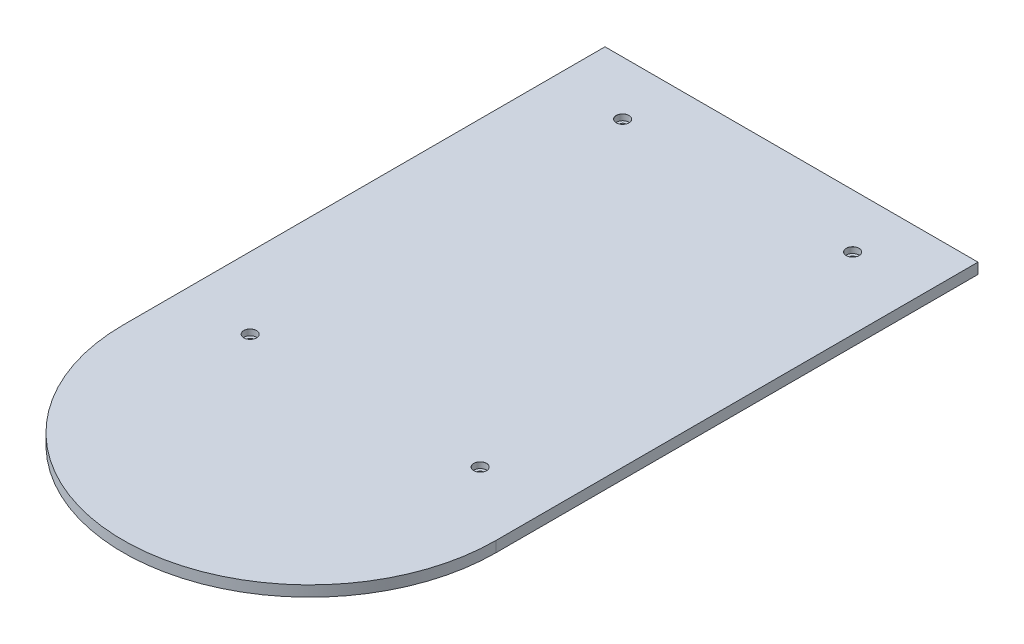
ISO-10303-21;
HEADER;
FILE_DESCRIPTION(('STEP AP214'),'2;1');
FILE_NAME('part.step','',(''),(''),'','','');
FILE_SCHEMA(('AUTOMOTIVE_DESIGN { 1 0 10303 214 1 1 1 1 }'));
ENDSEC;
DATA;
#1=APPLICATION_CONTEXT('core data for automotive mechanical design processes');
#2=APPLICATION_PROTOCOL_DEFINITION('international standard','automotive_design',2000,#1);
#3=PRODUCT_CONTEXT('',#1,'mechanical');
#4=PRODUCT('Part','Part','',(#3));
#5=PRODUCT_RELATED_PRODUCT_CATEGORY('part','',(#4));
#6=PRODUCT_DEFINITION_FORMATION('','',#4);
#7=PRODUCT_DEFINITION_CONTEXT('part definition',#1,'design');
#8=PRODUCT_DEFINITION('design','',#6,#7);
#9=PRODUCT_DEFINITION_SHAPE('','',#8);
#10=(LENGTH_UNIT() NAMED_UNIT(*) SI_UNIT(.MILLI.,.METRE.));
#11=(NAMED_UNIT(*) PLANE_ANGLE_UNIT() SI_UNIT($,.RADIAN.));
#12=(NAMED_UNIT(*) SI_UNIT($,.STERADIAN.) SOLID_ANGLE_UNIT());
#13=UNCERTAINTY_MEASURE_WITH_UNIT(LENGTH_MEASURE(1.E-05),#10,'distance_accuracy_value','');
#14=(GEOMETRIC_REPRESENTATION_CONTEXT(3) GLOBAL_UNCERTAINTY_ASSIGNED_CONTEXT((#13)) GLOBAL_UNIT_ASSIGNED_CONTEXT((#10,
#11,#12)) REPRESENTATION_CONTEXT('',''));
#15=CARTESIAN_POINT('',(0.,0.,0.));
#16=DIRECTION('',(0.,0.,1.));
#17=DIRECTION('',(1.,0.,0.));
#18=AXIS2_PLACEMENT_3D('',#15,#16,#17);
#19=CARTESIAN_POINT('',(95.25,5.461,123.03125));
#20=DIRECTION('',(-1.,0.,0.));
#21=DIRECTION('',(0.,0.,1.));
#22=AXIS2_PLACEMENT_3D('',#19,#20,#21);
#23=PLANE('',#22);
#24=DIRECTION('',(0.,0.,-1.));
#25=VECTOR('',#24,1.);
#26=CARTESIAN_POINT('',(95.25,0.,123.03125));
#27=LINE('',#26,#25);
#28=CARTESIAN_POINT('',(95.25,0.,123.03125));
#29=VERTEX_POINT('',#28);
#30=CARTESIAN_POINT('',(95.25,0.,-123.03125));
#31=VERTEX_POINT('',#30);
#32=EDGE_CURVE('E100',#29,#31,#27,.T.);
#33=ORIENTED_EDGE('',*,*,#32,.T.);
#34=DIRECTION('',(0.,-1.,0.));
#35=VECTOR('',#34,1.);
#36=CARTESIAN_POINT('',(95.25,5.461,-123.03125));
#37=LINE('',#36,#35);
#38=CARTESIAN_POINT('',(95.25,5.461,-123.03125));
#39=VERTEX_POINT('',#38);
#40=EDGE_CURVE('E11',#39,#31,#37,.T.);
#41=ORIENTED_EDGE('',*,*,#40,.F.);
#42=DIRECTION('',(0.,0.,-1.));
#43=VECTOR('',#42,1.);
#44=CARTESIAN_POINT('',(95.25,5.461,123.03125));
#45=LINE('',#44,#43);
#46=CARTESIAN_POINT('',(95.25,5.461,123.03125));
#47=VERTEX_POINT('',#46);
#48=EDGE_CURVE('E88',#47,#39,#45,.T.);
#49=ORIENTED_EDGE('',*,*,#48,.F.);
#50=DIRECTION('',(0.,-1.,0.));
#51=VECTOR('',#50,1.);
#52=CARTESIAN_POINT('',(95.25,5.461,123.03125));
#53=LINE('',#52,#51);
#54=EDGE_CURVE('E96',#47,#29,#53,.T.);
#55=ORIENTED_EDGE('',*,*,#54,.T.);
#56=EDGE_LOOP('',(#33,#41,#49,#55));
#57=FACE_BOUND('',#56,.T.);
#58=ADVANCED_FACE('F37',(#57),#23,.F.);
#59=CARTESIAN_POINT('',(-95.25,5.461,-123.03125));
#60=DIRECTION('',(0.,0.,1.));
#61=DIRECTION('',(1.,0.,0.));
#62=AXIS2_PLACEMENT_3D('',#59,#60,#61);
#63=PLANE('',#62);
#64=DIRECTION('',(-1.,0.,0.));
#65=VECTOR('',#64,1.);
#66=CARTESIAN_POINT('',(-95.25,0.,-123.03125));
#67=LINE('',#66,#65);
#68=CARTESIAN_POINT('',(-95.25,0.,-123.03125));
#69=VERTEX_POINT('',#68);
#70=EDGE_CURVE('E92',#31,#69,#67,.T.);
#71=ORIENTED_EDGE('',*,*,#70,.T.);
#72=DIRECTION('',(0.,-1.,0.));
#73=VECTOR('',#72,1.);
#74=CARTESIAN_POINT('',(-95.25,5.461,-123.03125));
#75=LINE('',#74,#73);
#76=CARTESIAN_POINT('',(-95.25,5.461,-123.03125));
#77=VERTEX_POINT('',#76);
#78=EDGE_CURVE('E45',#77,#69,#75,.T.);
#79=ORIENTED_EDGE('',*,*,#78,.F.);
#80=DIRECTION('',(-1.,0.,0.));
#81=VECTOR('',#80,1.);
#82=CARTESIAN_POINT('',(-95.25,5.461,-123.03125));
#83=LINE('',#82,#81);
#84=EDGE_CURVE('E83',#39,#77,#83,.T.);
#85=ORIENTED_EDGE('',*,*,#84,.F.);
#86=ORIENTED_EDGE('',*,*,#40,.T.);
#87=EDGE_LOOP('',(#71,#79,#85,#86));
#88=FACE_BOUND('',#87,.T.);
#89=ADVANCED_FACE('F91',(#88),#63,.F.);
#90=CARTESIAN_POINT('',(-95.25,5.461,123.03125));
#91=DIRECTION('',(1.,0.,0.));
#92=DIRECTION('',(0.,0.,-1.));
#93=AXIS2_PLACEMENT_3D('',#90,#91,#92);
#94=PLANE('',#93);
#95=DIRECTION('',(0.,0.,1.));
#96=VECTOR('',#95,1.);
#97=CARTESIAN_POINT('',(-95.25,0.,123.03125));
#98=LINE('',#97,#96);
#99=CARTESIAN_POINT('',(-95.25,0.,123.03125));
#100=VERTEX_POINT('',#99);
#101=EDGE_CURVE('E70',#69,#100,#98,.T.);
#102=ORIENTED_EDGE('',*,*,#101,.T.);
#103=DIRECTION('',(0.,-1.,0.));
#104=VECTOR('',#103,1.);
#105=CARTESIAN_POINT('',(-95.25,5.461,123.03125));
#106=LINE('',#105,#104);
#107=CARTESIAN_POINT('',(-95.25,5.461,123.03125));
#108=VERTEX_POINT('',#107);
#109=EDGE_CURVE('E93',#108,#100,#106,.T.);
#110=ORIENTED_EDGE('',*,*,#109,.F.);
#111=DIRECTION('',(0.,0.,1.));
#112=VECTOR('',#111,1.);
#113=CARTESIAN_POINT('',(-95.25,5.461,123.03125));
#114=LINE('',#113,#112);
#115=EDGE_CURVE('E86',#77,#108,#114,.T.);
#116=ORIENTED_EDGE('',*,*,#115,.F.);
#117=ORIENTED_EDGE('',*,*,#78,.T.);
#118=EDGE_LOOP('',(#102,#110,#116,#117));
#119=FACE_BOUND('',#118,.T.);
#120=ADVANCED_FACE('F94',(#119),#94,.F.);
#121=CARTESIAN_POINT('',(0.,5.461,123.03125));
#122=DIRECTION('',(0.,-1.,0.));
#123=DIRECTION('',(0.,0.,-1.));
#124=AXIS2_PLACEMENT_3D('',#121,#122,#123);
#125=CYLINDRICAL_SURFACE('',#124,95.25);
#126=CARTESIAN_POINT('',(0.,0.,123.03125));
#127=DIRECTION('',(0.,1.,0.));
#128=DIRECTION('',(0.,0.,-1.));
#129=AXIS2_PLACEMENT_3D('',#126,#127,#128);
#130=CIRCLE('',#129,95.25);
#131=EDGE_CURVE('E76',#100,#29,#130,.T.);
#132=ORIENTED_EDGE('',*,*,#131,.T.);
#133=ORIENTED_EDGE('',*,*,#54,.F.);
#134=CARTESIAN_POINT('',(0.,5.461,123.03125));
#135=DIRECTION('',(0.,1.,0.));
#136=DIRECTION('',(0.,0.,-1.));
#137=AXIS2_PLACEMENT_3D('',#134,#135,#136);
#138=CIRCLE('',#137,95.25);
#139=EDGE_CURVE('E53',#108,#47,#138,.T.);
#140=ORIENTED_EDGE('',*,*,#139,.F.);
#141=ORIENTED_EDGE('',*,*,#109,.T.);
#142=EDGE_LOOP('',(#132,#133,#140,#141));
#143=FACE_BOUND('',#142,.T.);
#144=ADVANCED_FACE('F108',(#143),#125,.T.);
#145=CARTESIAN_POINT('',(0.,5.461,123.03125));
#146=DIRECTION('',(0.,-1.,0.));
#147=DIRECTION('',(0.,0.,-1.));
#148=AXIS2_PLACEMENT_3D('',#145,#146,#147);
#149=PLANE('',#148);
#150=CARTESIAN_POINT('',(-58.7375,5.461,-95.53575));
#151=DIRECTION('',(0.,1.,0.));
#152=DIRECTION('',(0.,0.,1.));
#153=AXIS2_PLACEMENT_3D('',#150,#151,#152);
#154=CIRCLE('',#153,3.275);
#155=CARTESIAN_POINT('',(-58.7375,5.461,-92.26075));
#156=VERTEX_POINT('',#155);
#157=EDGE_CURVE('E170',#156,#156,#154,.T.);
#158=ORIENTED_EDGE('',*,*,#157,.F.);
#159=EDGE_LOOP('',(#158));
#160=FACE_BOUND('',#159,.T.);
#161=CARTESIAN_POINT('',(58.7375,5.461,-95.53575));
#162=DIRECTION('',(0.,1.,0.));
#163=DIRECTION('',(0.,0.,1.));
#164=AXIS2_PLACEMENT_3D('',#161,#162,#163);
#165=CIRCLE('',#164,3.275);
#166=CARTESIAN_POINT('',(58.7375,5.461,-92.26075));
#167=VERTEX_POINT('',#166);
#168=EDGE_CURVE('E155',#167,#167,#165,.T.);
#169=ORIENTED_EDGE('',*,*,#168,.F.);
#170=EDGE_LOOP('',(#169));
#171=FACE_BOUND('',#170,.T.);
#172=CARTESIAN_POINT('',(58.7375,5.461,94.69755));
#173=DIRECTION('',(0.,1.,0.));
#174=DIRECTION('',(0.,0.,1.));
#175=AXIS2_PLACEMENT_3D('',#172,#173,#174);
#176=CIRCLE('',#175,3.275);
#177=CARTESIAN_POINT('',(58.7375,5.461,97.97255));
#178=VERTEX_POINT('',#177);
#179=EDGE_CURVE('E140',#178,#178,#176,.T.);
#180=ORIENTED_EDGE('',*,*,#179,.F.);
#181=EDGE_LOOP('',(#180));
#182=FACE_BOUND('',#181,.T.);
#183=CARTESIAN_POINT('',(-58.7375,5.461,94.69755));
#184=DIRECTION('',(0.,1.,0.));
#185=DIRECTION('',(0.,0.,1.));
#186=AXIS2_PLACEMENT_3D('',#183,#184,#185);
#187=CIRCLE('',#186,3.275);
#188=CARTESIAN_POINT('',(-58.7375,5.461,97.97255));
#189=VERTEX_POINT('',#188);
#190=EDGE_CURVE('E125',#189,#189,#187,.T.);
#191=ORIENTED_EDGE('',*,*,#190,.F.);
#192=EDGE_LOOP('',(#191));
#193=FACE_BOUND('',#192,.T.);
#194=ORIENTED_EDGE('',*,*,#48,.T.);
#195=ORIENTED_EDGE('',*,*,#84,.T.);
#196=ORIENTED_EDGE('',*,*,#115,.T.);
#197=ORIENTED_EDGE('',*,*,#139,.T.);
#198=EDGE_LOOP('',(#194,#195,#196,#197));
#199=FACE_BOUND('',#198,.T.);
#200=ADVANCED_FACE('F84',(#160,#171,#182,#193,#199),#149,.F.);
#201=CARTESIAN_POINT('',(0.,0.,123.03125));
#202=DIRECTION('',(0.,-1.,0.));
#203=DIRECTION('',(0.,0.,-1.));
#204=AXIS2_PLACEMENT_3D('',#201,#202,#203);
#205=PLANE('',#204);
#206=CARTESIAN_POINT('',(-58.7375,0.,-95.53575));
#207=DIRECTION('',(0.,1.,0.));
#208=DIRECTION('',(0.,0.,1.));
#209=AXIS2_PLACEMENT_3D('',#206,#207,#208);
#210=CIRCLE('',#209,1.7);
#211=CARTESIAN_POINT('',(-58.7375,0.,-93.83575));
#212=VERTEX_POINT('',#211);
#213=EDGE_CURVE('E158',#212,#212,#210,.T.);
#214=ORIENTED_EDGE('',*,*,#213,.T.);
#215=EDGE_LOOP('',(#214));
#216=FACE_BOUND('',#215,.T.);
#217=CARTESIAN_POINT('',(58.7375,0.,-95.53575));
#218=DIRECTION('',(0.,1.,0.));
#219=DIRECTION('',(0.,0.,1.));
#220=AXIS2_PLACEMENT_3D('',#217,#218,#219);
#221=CIRCLE('',#220,1.7);
#222=CARTESIAN_POINT('',(58.7375,0.,-93.83575));
#223=VERTEX_POINT('',#222);
#224=EDGE_CURVE('E143',#223,#223,#221,.T.);
#225=ORIENTED_EDGE('',*,*,#224,.T.);
#226=EDGE_LOOP('',(#225));
#227=FACE_BOUND('',#226,.T.);
#228=CARTESIAN_POINT('',(58.7375,0.,94.69755));
#229=DIRECTION('',(0.,1.,0.));
#230=DIRECTION('',(0.,0.,1.));
#231=AXIS2_PLACEMENT_3D('',#228,#229,#230);
#232=CIRCLE('',#231,1.7);
#233=CARTESIAN_POINT('',(58.7375,0.,96.39755));
#234=VERTEX_POINT('',#233);
#235=EDGE_CURVE('E128',#234,#234,#232,.T.);
#236=ORIENTED_EDGE('',*,*,#235,.T.);
#237=EDGE_LOOP('',(#236));
#238=FACE_BOUND('',#237,.T.);
#239=CARTESIAN_POINT('',(-58.7375,0.,94.69755));
#240=DIRECTION('',(0.,1.,0.));
#241=DIRECTION('',(0.,0.,1.));
#242=AXIS2_PLACEMENT_3D('',#239,#240,#241);
#243=CIRCLE('',#242,1.7);
#244=CARTESIAN_POINT('',(-58.7375,0.,96.39755));
#245=VERTEX_POINT('',#244);
#246=EDGE_CURVE('E103',#245,#245,#243,.T.);
#247=ORIENTED_EDGE('',*,*,#246,.T.);
#248=EDGE_LOOP('',(#247));
#249=FACE_BOUND('',#248,.T.);
#250=ORIENTED_EDGE('',*,*,#32,.F.);
#251=ORIENTED_EDGE('',*,*,#131,.F.);
#252=ORIENTED_EDGE('',*,*,#101,.F.);
#253=ORIENTED_EDGE('',*,*,#70,.F.);
#254=EDGE_LOOP('',(#250,#251,#252,#253));
#255=FACE_BOUND('',#254,.T.);
#256=ADVANCED_FACE('F111',(#216,#227,#238,#249,#255),#205,.T.);
#257=CARTESIAN_POINT('',(-58.7375,5.461,94.69755));
#258=DIRECTION('',(0.,1.,0.));
#259=DIRECTION('',(0.,0.,1.));
#260=AXIS2_PLACEMENT_3D('',#257,#258,#259);
#261=CYLINDRICAL_SURFACE('',#260,1.7);
#262=ORIENTED_EDGE('',*,*,#246,.F.);
#263=EDGE_LOOP('',(#262));
#264=FACE_BOUND('',#263,.T.);
#265=CARTESIAN_POINT('',(-58.7375,2.46100000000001,94.69755));
#266=DIRECTION('',(0.,1.,0.));
#267=DIRECTION('',(0.,0.,1.));
#268=AXIS2_PLACEMENT_3D('',#265,#266,#267);
#269=CIRCLE('',#268,1.70000000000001);
#270=CARTESIAN_POINT('',(-58.7375,2.46100000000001,96.39755));
#271=VERTEX_POINT('',#270);
#272=EDGE_CURVE('E116',#271,#271,#269,.T.);
#273=ORIENTED_EDGE('',*,*,#272,.T.);
#274=EDGE_LOOP('',(#273));
#275=FACE_BOUND('',#274,.T.);
#276=ADVANCED_FACE('F214',(#264,#275),#261,.F.);
#277=CARTESIAN_POINT('',(-55.4875,2.46100000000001,94.69755));
#278=DIRECTION('',(0.,-1.,0.));
#279=DIRECTION('',(0.,0.,-1.));
#280=AXIS2_PLACEMENT_3D('',#277,#278,#279);
#281=PLANE('',#280);
#282=ORIENTED_EDGE('',*,*,#272,.F.);
#283=EDGE_LOOP('',(#282));
#284=FACE_BOUND('',#283,.T.);
#285=CARTESIAN_POINT('',(-58.7375,2.46100000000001,94.69755));
#286=DIRECTION('',(0.,1.,0.));
#287=DIRECTION('',(0.,0.,1.));
#288=AXIS2_PLACEMENT_3D('',#285,#286,#287);
#289=CIRCLE('',#288,3.25);
#290=CARTESIAN_POINT('',(-58.7375,2.46100000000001,97.94755));
#291=VERTEX_POINT('',#290);
#292=EDGE_CURVE('E119',#291,#291,#289,.T.);
#293=ORIENTED_EDGE('',*,*,#292,.T.);
#294=EDGE_LOOP('',(#293));
#295=FACE_BOUND('',#294,.T.);
#296=ADVANCED_FACE('F198',(#284,#295),#281,.F.);
#297=CARTESIAN_POINT('',(-58.7375,5.461,94.69755));
#298=DIRECTION('',(0.,1.,0.));
#299=DIRECTION('',(0.,0.,1.));
#300=AXIS2_PLACEMENT_3D('',#297,#298,#299);
#301=CYLINDRICAL_SURFACE('',#300,3.25);
#302=ORIENTED_EDGE('',*,*,#292,.F.);
#303=EDGE_LOOP('',(#302));
#304=FACE_BOUND('',#303,.T.);
#305=CARTESIAN_POINT('',(-58.7375,5.43600000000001,94.69755));
#306=DIRECTION('',(0.,1.,0.));
#307=DIRECTION('',(0.,0.,1.));
#308=AXIS2_PLACEMENT_3D('',#305,#306,#307);
#309=CIRCLE('',#308,3.25);
#310=CARTESIAN_POINT('',(-58.7375,5.43600000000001,97.94755));
#311=VERTEX_POINT('',#310);
#312=EDGE_CURVE('E122',#311,#311,#309,.T.);
#313=ORIENTED_EDGE('',*,*,#312,.T.);
#314=EDGE_LOOP('',(#313));
#315=FACE_BOUND('',#314,.T.);
#316=ADVANCED_FACE('F188',(#304,#315),#301,.F.);
#317=CARTESIAN_POINT('',(-58.7375,5.461,94.69755));
#318=DIRECTION('',(0.,1.,0.));
#319=DIRECTION('',(0.,0.,1.));
#320=AXIS2_PLACEMENT_3D('',#317,#318,#319);
#321=CONICAL_SURFACE('',#320,3.275,0.785398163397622);
#322=ORIENTED_EDGE('',*,*,#312,.F.);
#323=EDGE_LOOP('',(#322));
#324=FACE_BOUND('',#323,.T.);
#325=ORIENTED_EDGE('',*,*,#190,.T.);
#326=EDGE_LOOP('',(#325));
#327=FACE_BOUND('',#326,.T.);
#328=ADVANCED_FACE('F185',(#324,#327),#321,.F.);
#329=CARTESIAN_POINT('',(58.7375,5.461,94.69755));
#330=DIRECTION('',(0.,1.,0.));
#331=DIRECTION('',(0.,0.,1.));
#332=AXIS2_PLACEMENT_3D('',#329,#330,#331);
#333=CYLINDRICAL_SURFACE('',#332,1.7);
#334=ORIENTED_EDGE('',*,*,#235,.F.);
#335=EDGE_LOOP('',(#334));
#336=FACE_BOUND('',#335,.T.);
#337=CARTESIAN_POINT('',(58.7375,2.46100000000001,94.69755));
#338=DIRECTION('',(0.,1.,0.));
#339=DIRECTION('',(0.,0.,1.));
#340=AXIS2_PLACEMENT_3D('',#337,#338,#339);
#341=CIRCLE('',#340,1.70000000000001);
#342=CARTESIAN_POINT('',(58.7375,2.46100000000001,96.39755));
#343=VERTEX_POINT('',#342);
#344=EDGE_CURVE('E131',#343,#343,#341,.T.);
#345=ORIENTED_EDGE('',*,*,#344,.T.);
#346=EDGE_LOOP('',(#345));
#347=FACE_BOUND('',#346,.T.);
#348=ADVANCED_FACE('F187',(#336,#347),#333,.F.);
#349=CARTESIAN_POINT('',(61.9875,2.46100000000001,94.69755));
#350=DIRECTION('',(0.,-1.,0.));
#351=DIRECTION('',(0.,0.,-1.));
#352=AXIS2_PLACEMENT_3D('',#349,#350,#351);
#353=PLANE('',#352);
#354=ORIENTED_EDGE('',*,*,#344,.F.);
#355=EDGE_LOOP('',(#354));
#356=FACE_BOUND('',#355,.T.);
#357=CARTESIAN_POINT('',(58.7375,2.46100000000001,94.69755));
#358=DIRECTION('',(0.,1.,0.));
#359=DIRECTION('',(0.,0.,1.));
#360=AXIS2_PLACEMENT_3D('',#357,#358,#359);
#361=CIRCLE('',#360,3.25);
#362=CARTESIAN_POINT('',(58.7375,2.46100000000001,97.94755));
#363=VERTEX_POINT('',#362);
#364=EDGE_CURVE('E134',#363,#363,#361,.T.);
#365=ORIENTED_EDGE('',*,*,#364,.T.);
#366=EDGE_LOOP('',(#365));
#367=FACE_BOUND('',#366,.T.);
#368=ADVANCED_FACE('F195',(#356,#367),#353,.F.);
#369=CARTESIAN_POINT('',(58.7375,5.461,94.69755));
#370=DIRECTION('',(0.,1.,0.));
#371=DIRECTION('',(0.,0.,1.));
#372=AXIS2_PLACEMENT_3D('',#369,#370,#371);
#373=CYLINDRICAL_SURFACE('',#372,3.25);
#374=ORIENTED_EDGE('',*,*,#364,.F.);
#375=EDGE_LOOP('',(#374));
#376=FACE_BOUND('',#375,.T.);
#377=CARTESIAN_POINT('',(58.7375,5.43600000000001,94.69755));
#378=DIRECTION('',(0.,1.,0.));
#379=DIRECTION('',(0.,0.,1.));
#380=AXIS2_PLACEMENT_3D('',#377,#378,#379);
#381=CIRCLE('',#380,3.25);
#382=CARTESIAN_POINT('',(58.7375,5.43600000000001,97.94755));
#383=VERTEX_POINT('',#382);
#384=EDGE_CURVE('E137',#383,#383,#381,.T.);
#385=ORIENTED_EDGE('',*,*,#384,.T.);
#386=EDGE_LOOP('',(#385));
#387=FACE_BOUND('',#386,.T.);
#388=ADVANCED_FACE('F254',(#376,#387),#373,.F.);
#389=CARTESIAN_POINT('',(58.7375,5.461,94.69755));
#390=DIRECTION('',(0.,1.,0.));
#391=DIRECTION('',(0.,0.,1.));
#392=AXIS2_PLACEMENT_3D('',#389,#390,#391);
#393=CONICAL_SURFACE('',#392,3.275,0.785398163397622);
#394=ORIENTED_EDGE('',*,*,#384,.F.);
#395=EDGE_LOOP('',(#394));
#396=FACE_BOUND('',#395,.T.);
#397=ORIENTED_EDGE('',*,*,#179,.T.);
#398=EDGE_LOOP('',(#397));
#399=FACE_BOUND('',#398,.T.);
#400=ADVANCED_FACE('F264',(#396,#399),#393,.F.);
#401=CARTESIAN_POINT('',(58.7375,5.461,-95.53575));
#402=DIRECTION('',(0.,1.,0.));
#403=DIRECTION('',(0.,0.,1.));
#404=AXIS2_PLACEMENT_3D('',#401,#402,#403);
#405=CYLINDRICAL_SURFACE('',#404,1.7);
#406=ORIENTED_EDGE('',*,*,#224,.F.);
#407=EDGE_LOOP('',(#406));
#408=FACE_BOUND('',#407,.T.);
#409=CARTESIAN_POINT('',(58.7375,2.46100000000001,-95.53575));
#410=DIRECTION('',(0.,1.,0.));
#411=DIRECTION('',(0.,0.,1.));
#412=AXIS2_PLACEMENT_3D('',#409,#410,#411);
#413=CIRCLE('',#412,1.70000000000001);
#414=CARTESIAN_POINT('',(58.7375,2.46100000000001,-93.83575));
#415=VERTEX_POINT('',#414);
#416=EDGE_CURVE('E146',#415,#415,#413,.T.);
#417=ORIENTED_EDGE('',*,*,#416,.T.);
#418=EDGE_LOOP('',(#417));
#419=FACE_BOUND('',#418,.T.);
#420=ADVANCED_FACE('F274',(#408,#419),#405,.F.);
#421=CARTESIAN_POINT('',(61.9875,2.46100000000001,-95.53575));
#422=DIRECTION('',(0.,-1.,0.));
#423=DIRECTION('',(0.,0.,-1.));
#424=AXIS2_PLACEMENT_3D('',#421,#422,#423);
#425=PLANE('',#424);
#426=ORIENTED_EDGE('',*,*,#416,.F.);
#427=EDGE_LOOP('',(#426));
#428=FACE_BOUND('',#427,.T.);
#429=CARTESIAN_POINT('',(58.7375,2.46100000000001,-95.53575));
#430=DIRECTION('',(0.,1.,0.));
#431=DIRECTION('',(0.,0.,1.));
#432=AXIS2_PLACEMENT_3D('',#429,#430,#431);
#433=CIRCLE('',#432,3.25);
#434=CARTESIAN_POINT('',(58.7375,2.46100000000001,-92.28575));
#435=VERTEX_POINT('',#434);
#436=EDGE_CURVE('E149',#435,#435,#433,.T.);
#437=ORIENTED_EDGE('',*,*,#436,.T.);
#438=EDGE_LOOP('',(#437));
#439=FACE_BOUND('',#438,.T.);
#440=ADVANCED_FACE('F284',(#428,#439),#425,.F.);
#441=CARTESIAN_POINT('',(58.7375,5.461,-95.53575));
#442=DIRECTION('',(0.,1.,0.));
#443=DIRECTION('',(0.,0.,1.));
#444=AXIS2_PLACEMENT_3D('',#441,#442,#443);
#445=CYLINDRICAL_SURFACE('',#444,3.25);
#446=ORIENTED_EDGE('',*,*,#436,.F.);
#447=EDGE_LOOP('',(#446));
#448=FACE_BOUND('',#447,.T.);
#449=CARTESIAN_POINT('',(58.7375,5.43600000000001,-95.53575));
#450=DIRECTION('',(0.,1.,0.));
#451=DIRECTION('',(0.,0.,1.));
#452=AXIS2_PLACEMENT_3D('',#449,#450,#451);
#453=CIRCLE('',#452,3.25);
#454=CARTESIAN_POINT('',(58.7375,5.43600000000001,-92.28575));
#455=VERTEX_POINT('',#454);
#456=EDGE_CURVE('E152',#455,#455,#453,.T.);
#457=ORIENTED_EDGE('',*,*,#456,.T.);
#458=EDGE_LOOP('',(#457));
#459=FACE_BOUND('',#458,.T.);
#460=ADVANCED_FACE('F294',(#448,#459),#445,.F.);
#461=CARTESIAN_POINT('',(58.7375,5.461,-95.53575));
#462=DIRECTION('',(0.,1.,0.));
#463=DIRECTION('',(0.,0.,1.));
#464=AXIS2_PLACEMENT_3D('',#461,#462,#463);
#465=CONICAL_SURFACE('',#464,3.275,0.785398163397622);
#466=ORIENTED_EDGE('',*,*,#456,.F.);
#467=EDGE_LOOP('',(#466));
#468=FACE_BOUND('',#467,.T.);
#469=ORIENTED_EDGE('',*,*,#168,.T.);
#470=EDGE_LOOP('',(#469));
#471=FACE_BOUND('',#470,.T.);
#472=ADVANCED_FACE('F304',(#468,#471),#465,.F.);
#473=CARTESIAN_POINT('',(-58.7375,5.461,-95.53575));
#474=DIRECTION('',(0.,1.,0.));
#475=DIRECTION('',(0.,0.,1.));
#476=AXIS2_PLACEMENT_3D('',#473,#474,#475);
#477=CYLINDRICAL_SURFACE('',#476,1.7);
#478=ORIENTED_EDGE('',*,*,#213,.F.);
#479=EDGE_LOOP('',(#478));
#480=FACE_BOUND('',#479,.T.);
#481=CARTESIAN_POINT('',(-58.7375,2.46100000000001,-95.53575));
#482=DIRECTION('',(0.,1.,0.));
#483=DIRECTION('',(0.,0.,1.));
#484=AXIS2_PLACEMENT_3D('',#481,#482,#483);
#485=CIRCLE('',#484,1.70000000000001);
#486=CARTESIAN_POINT('',(-58.7375,2.46100000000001,-93.83575));
#487=VERTEX_POINT('',#486);
#488=EDGE_CURVE('E161',#487,#487,#485,.T.);
#489=ORIENTED_EDGE('',*,*,#488,.T.);
#490=EDGE_LOOP('',(#489));
#491=FACE_BOUND('',#490,.T.);
#492=ADVANCED_FACE('F314',(#480,#491),#477,.F.);
#493=CARTESIAN_POINT('',(-55.4875,2.46100000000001,-95.53575));
#494=DIRECTION('',(0.,-1.,0.));
#495=DIRECTION('',(0.,0.,-1.));
#496=AXIS2_PLACEMENT_3D('',#493,#494,#495);
#497=PLANE('',#496);
#498=ORIENTED_EDGE('',*,*,#488,.F.);
#499=EDGE_LOOP('',(#498));
#500=FACE_BOUND('',#499,.T.);
#501=CARTESIAN_POINT('',(-58.7375,2.46100000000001,-95.53575));
#502=DIRECTION('',(0.,1.,0.));
#503=DIRECTION('',(0.,0.,1.));
#504=AXIS2_PLACEMENT_3D('',#501,#502,#503);
#505=CIRCLE('',#504,3.25);
#506=CARTESIAN_POINT('',(-58.7375,2.46100000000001,-92.28575));
#507=VERTEX_POINT('',#506);
#508=EDGE_CURVE('E164',#507,#507,#505,.T.);
#509=ORIENTED_EDGE('',*,*,#508,.T.);
#510=EDGE_LOOP('',(#509));
#511=FACE_BOUND('',#510,.T.);
#512=ADVANCED_FACE('F324',(#500,#511),#497,.F.);
#513=CARTESIAN_POINT('',(-58.7375,5.461,-95.53575));
#514=DIRECTION('',(0.,1.,0.));
#515=DIRECTION('',(0.,0.,1.));
#516=AXIS2_PLACEMENT_3D('',#513,#514,#515);
#517=CYLINDRICAL_SURFACE('',#516,3.25);
#518=ORIENTED_EDGE('',*,*,#508,.F.);
#519=EDGE_LOOP('',(#518));
#520=FACE_BOUND('',#519,.T.);
#521=CARTESIAN_POINT('',(-58.7375,5.43600000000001,-95.53575));
#522=DIRECTION('',(0.,1.,0.));
#523=DIRECTION('',(0.,0.,1.));
#524=AXIS2_PLACEMENT_3D('',#521,#522,#523);
#525=CIRCLE('',#524,3.25);
#526=CARTESIAN_POINT('',(-58.7375,5.43600000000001,-92.28575));
#527=VERTEX_POINT('',#526);
#528=EDGE_CURVE('E167',#527,#527,#525,.T.);
#529=ORIENTED_EDGE('',*,*,#528,.T.);
#530=EDGE_LOOP('',(#529));
#531=FACE_BOUND('',#530,.T.);
#532=ADVANCED_FACE('F334',(#520,#531),#517,.F.);
#533=CARTESIAN_POINT('',(-58.7375,5.461,-95.53575));
#534=DIRECTION('',(0.,1.,0.));
#535=DIRECTION('',(0.,0.,1.));
#536=AXIS2_PLACEMENT_3D('',#533,#534,#535);
#537=CONICAL_SURFACE('',#536,3.275,0.785398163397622);
#538=ORIENTED_EDGE('',*,*,#528,.F.);
#539=EDGE_LOOP('',(#538));
#540=FACE_BOUND('',#539,.T.);
#541=ORIENTED_EDGE('',*,*,#157,.T.);
#542=EDGE_LOOP('',(#541));
#543=FACE_BOUND('',#542,.T.);
#544=ADVANCED_FACE('F174',(#540,#543),#537,.F.);
#545=CLOSED_SHELL('',(#58,#89,#120,#144,#200,#256,#276,#296,#316,#328,#348,#368,#388,#400,#420,
#440,#460,#472,#492,#512,#532,#544));
#546=MANIFOLD_SOLID_BREP('B2',#545);
#547=ADVANCED_BREP_SHAPE_REPRESENTATION('',(#18,#546),#14);
#548=SHAPE_DEFINITION_REPRESENTATION(#9,#547);
ENDSEC;
END-ISO-10303-21;
